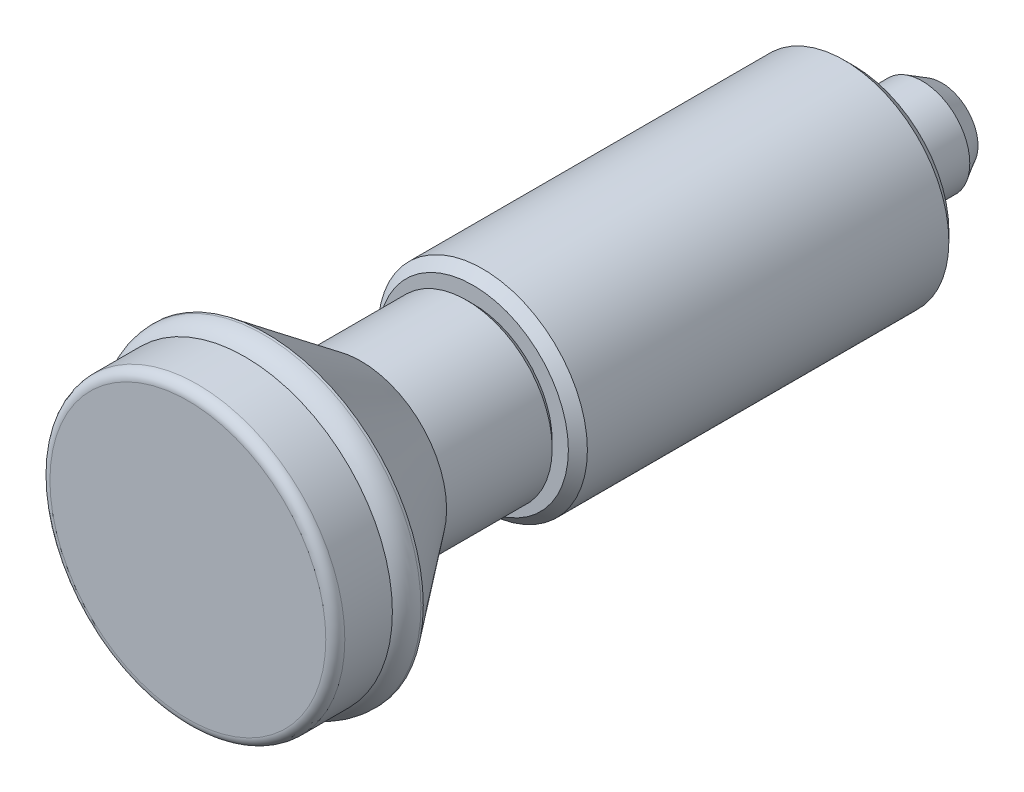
ISO-10303-21;
HEADER;
FILE_DESCRIPTION(('STEP AP214'),'2;1');
FILE_NAME('part.step','',(''),(''),'','','');
FILE_SCHEMA(('AUTOMOTIVE_DESIGN { 1 0 10303 214 1 1 1 1 }'));
ENDSEC;
DATA;
#1=APPLICATION_CONTEXT('core data for automotive mechanical design processes');
#2=APPLICATION_PROTOCOL_DEFINITION('international standard','automotive_design',2000,#1);
#3=PRODUCT_CONTEXT('',#1,'mechanical');
#4=PRODUCT('Part','Part','',(#3));
#5=PRODUCT_RELATED_PRODUCT_CATEGORY('part','',(#4));
#6=PRODUCT_DEFINITION_FORMATION('','',#4);
#7=PRODUCT_DEFINITION_CONTEXT('part definition',#1,'design');
#8=PRODUCT_DEFINITION('design','',#6,#7);
#9=PRODUCT_DEFINITION_SHAPE('','',#8);
#10=(LENGTH_UNIT() NAMED_UNIT(*) SI_UNIT(.MILLI.,.METRE.));
#11=(NAMED_UNIT(*) PLANE_ANGLE_UNIT() SI_UNIT($,.RADIAN.));
#12=(NAMED_UNIT(*) SI_UNIT($,.STERADIAN.) SOLID_ANGLE_UNIT());
#13=UNCERTAINTY_MEASURE_WITH_UNIT(LENGTH_MEASURE(1.E-05),#10,'distance_accuracy_value','');
#14=(GEOMETRIC_REPRESENTATION_CONTEXT(3) GLOBAL_UNCERTAINTY_ASSIGNED_CONTEXT((#13)) GLOBAL_UNIT_ASSIGNED_CONTEXT((#10,
#11,#12)) REPRESENTATION_CONTEXT('',''));
#15=CARTESIAN_POINT('',(0.,0.,0.));
#16=DIRECTION('',(0.,0.,1.));
#17=DIRECTION('',(1.,0.,0.));
#18=AXIS2_PLACEMENT_3D('',#15,#16,#17);
#19=CARTESIAN_POINT('',(0.,0.,69.));
#20=DIRECTION('',(0.,0.,1.));
#21=DIRECTION('',(1.,0.,0.));
#22=AXIS2_PLACEMENT_3D('',#19,#20,#21);
#23=TOROIDAL_SURFACE('',#22,14.5,0.999999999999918);
#24=CARTESIAN_POINT('',(0.,0.,69.));
#25=DIRECTION('',(0.,0.,1.));
#26=DIRECTION('',(1.,0.,0.));
#27=AXIS2_PLACEMENT_3D('',#24,#25,#26);
#28=CIRCLE('',#27,15.5);
#29=CARTESIAN_POINT('',(15.5,0.,69.));
#30=VERTEX_POINT('',#29);
#31=EDGE_CURVE('E8',#30,#30,#28,.T.);
#32=ORIENTED_EDGE('',*,*,#31,.T.);
#33=EDGE_LOOP('',(#32));
#34=FACE_BOUND('',#33,.T.);
#35=CARTESIAN_POINT('',(0.,0.,70.));
#36=DIRECTION('',(0.,0.,1.));
#37=DIRECTION('',(1.,0.,0.));
#38=AXIS2_PLACEMENT_3D('',#35,#36,#37);
#39=CIRCLE('',#38,14.5);
#40=CARTESIAN_POINT('',(14.5,0.,70.));
#41=VERTEX_POINT('',#40);
#42=EDGE_CURVE('E61',#41,#41,#39,.T.);
#43=ORIENTED_EDGE('',*,*,#42,.F.);
#44=EDGE_LOOP('',(#43));
#45=FACE_BOUND('',#44,.T.);
#46=ADVANCED_FACE('F12',(#34,#45),#23,.T.);
#47=CARTESIAN_POINT('',(0.,0.,70.));
#48=DIRECTION('',(0.,0.,1.));
#49=DIRECTION('',(1.,0.,0.));
#50=AXIS2_PLACEMENT_3D('',#47,#48,#49);
#51=CYLINDRICAL_SURFACE('',#50,15.5);
#52=CARTESIAN_POINT('',(0.,0.,64.));
#53=DIRECTION('',(0.,0.,1.));
#54=DIRECTION('',(1.,0.,0.));
#55=AXIS2_PLACEMENT_3D('',#52,#53,#54);
#56=CIRCLE('',#55,15.5);
#57=CARTESIAN_POINT('',(15.5,0.,64.));
#58=VERTEX_POINT('',#57);
#59=EDGE_CURVE('E18',#58,#58,#56,.T.);
#60=ORIENTED_EDGE('',*,*,#59,.T.);
#61=EDGE_LOOP('',(#60));
#62=FACE_BOUND('',#61,.T.);
#63=ORIENTED_EDGE('',*,*,#31,.F.);
#64=EDGE_LOOP('',(#63));
#65=FACE_BOUND('',#64,.T.);
#66=ADVANCED_FACE('F68',(#62,#65),#51,.T.);
#67=CARTESIAN_POINT('',(0.,0.,62.0000000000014));
#68=DIRECTION('',(0.,0.,1.));
#69=DIRECTION('',(1.,0.,0.));
#70=AXIS2_PLACEMENT_3D('',#67,#68,#69);
#71=TOROIDAL_SURFACE('',#70,14.0000000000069,2.49999999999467);
#72=CARTESIAN_POINT('',(0.,0.,62.0000000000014));
#73=DIRECTION('',(0.,0.,1.));
#74=DIRECTION('',(1.,0.,0.));
#75=AXIS2_PLACEMENT_3D('',#72,#73,#74);
#76=CIRCLE('',#75,16.5000000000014);
#77=CARTESIAN_POINT('',(16.5000000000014,0.,62.0000000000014));
#78=VERTEX_POINT('',#77);
#79=EDGE_CURVE('E22',#78,#78,#76,.T.);
#80=ORIENTED_EDGE('',*,*,#79,.T.);
#81=EDGE_LOOP('',(#80));
#82=FACE_BOUND('',#81,.T.);
#83=ORIENTED_EDGE('',*,*,#59,.F.);
#84=EDGE_LOOP('',(#83));
#85=FACE_BOUND('',#84,.T.);
#86=ADVANCED_FACE('F73',(#82,#85),#71,.T.);
#87=CARTESIAN_POINT('',(0.,0.,70.));
#88=DIRECTION('',(0.,0.,1.));
#89=DIRECTION('',(1.,0.,0.));
#90=AXIS2_PLACEMENT_3D('',#87,#88,#89);
#91=CYLINDRICAL_SURFACE('',#90,16.5000000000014);
#92=CARTESIAN_POINT('',(0.,0.,61.7528361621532));
#93=DIRECTION('',(0.,0.,1.));
#94=DIRECTION('',(1.,0.,0.));
#95=AXIS2_PLACEMENT_3D('',#92,#93,#94);
#96=CIRCLE('',#95,16.5000000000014);
#97=CARTESIAN_POINT('',(16.5000000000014,0.,61.7528361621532));
#98=VERTEX_POINT('',#97);
#99=EDGE_CURVE('E26',#98,#98,#96,.T.);
#100=ORIENTED_EDGE('',*,*,#99,.T.);
#101=EDGE_LOOP('',(#100));
#102=FACE_BOUND('',#101,.T.);
#103=ORIENTED_EDGE('',*,*,#79,.F.);
#104=EDGE_LOOP('',(#103));
#105=FACE_BOUND('',#104,.T.);
#106=ADVANCED_FACE('F77',(#102,#105),#91,.T.);
#107=CARTESIAN_POINT('',(0.,0.,61.7528361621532));
#108=DIRECTION('',(0.,0.,1.));
#109=DIRECTION('',(1.,0.,0.));
#110=AXIS2_PLACEMENT_3D('',#107,#108,#109);
#111=CONICAL_SURFACE('',#110,16.5000000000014,0.645771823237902);
#112=CARTESIAN_POINT('',(0.,0.,51.8));
#113=DIRECTION('',(0.,0.,1.));
#114=DIRECTION('',(1.,0.,0.));
#115=AXIS2_PLACEMENT_3D('',#112,#113,#114);
#116=CIRCLE('',#115,9.0000000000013);
#117=CARTESIAN_POINT('',(9.0000000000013,0.,51.8));
#118=VERTEX_POINT('',#117);
#119=EDGE_CURVE('E31',#118,#118,#116,.T.);
#120=ORIENTED_EDGE('',*,*,#119,.T.);
#121=EDGE_LOOP('',(#120));
#122=FACE_BOUND('',#121,.T.);
#123=ORIENTED_EDGE('',*,*,#99,.F.);
#124=EDGE_LOOP('',(#123));
#125=FACE_BOUND('',#124,.T.);
#126=ADVANCED_FACE('F84',(#122,#125),#111,.T.);
#127=CARTESIAN_POINT('',(0.,0.,70.));
#128=DIRECTION('',(0.,0.,1.));
#129=DIRECTION('',(1.,0.,0.));
#130=AXIS2_PLACEMENT_3D('',#127,#128,#129);
#131=CYLINDRICAL_SURFACE('',#130,9.0000000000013);
#132=CARTESIAN_POINT('',(0.,0.,40.7));
#133=DIRECTION('',(0.,0.,1.));
#134=DIRECTION('',(1.,0.,0.));
#135=AXIS2_PLACEMENT_3D('',#132,#133,#134);
#136=CIRCLE('',#135,9.0000000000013);
#137=CARTESIAN_POINT('',(9.0000000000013,0.,40.7));
#138=VERTEX_POINT('',#137);
#139=EDGE_CURVE('E34',#138,#138,#136,.T.);
#140=ORIENTED_EDGE('',*,*,#139,.T.);
#141=EDGE_LOOP('',(#140));
#142=FACE_BOUND('',#141,.T.);
#143=ORIENTED_EDGE('',*,*,#119,.F.);
#144=EDGE_LOOP('',(#143));
#145=FACE_BOUND('',#144,.T.);
#146=ADVANCED_FACE('F88',(#142,#145),#131,.T.);
#147=CARTESIAN_POINT('',(0.,0.,40.7));
#148=DIRECTION('',(0.,0.,1.));
#149=DIRECTION('',(1.,0.,0.));
#150=AXIS2_PLACEMENT_3D('',#147,#148,#149);
#151=CONICAL_SURFACE('',#150,9.0000000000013,0.785398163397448);
#152=CARTESIAN_POINT('',(0.,0.,40.));
#153=DIRECTION('',(0.,0.,1.));
#154=DIRECTION('',(1.,0.,0.));
#155=AXIS2_PLACEMENT_3D('',#152,#153,#154);
#156=CIRCLE('',#155,8.30000000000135);
#157=CARTESIAN_POINT('',(8.30000000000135,0.,40.));
#158=VERTEX_POINT('',#157);
#159=EDGE_CURVE('E37',#158,#158,#156,.T.);
#160=ORIENTED_EDGE('',*,*,#159,.T.);
#161=EDGE_LOOP('',(#160));
#162=FACE_BOUND('',#161,.T.);
#163=ORIENTED_EDGE('',*,*,#139,.F.);
#164=EDGE_LOOP('',(#163));
#165=FACE_BOUND('',#164,.T.);
#166=ADVANCED_FACE('F92',(#162,#165),#151,.T.);
#167=CARTESIAN_POINT('',(0.,10.0000000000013,40.));
#168=DIRECTION('',(0.,0.,1.));
#169=DIRECTION('',(1.,0.,0.));
#170=AXIS2_PLACEMENT_3D('',#167,#168,#169);
#171=PLANE('',#170);
#172=CARTESIAN_POINT('',(0.,0.,40.));
#173=DIRECTION('',(0.,0.,1.));
#174=DIRECTION('',(1.,0.,0.));
#175=AXIS2_PLACEMENT_3D('',#172,#173,#174);
#176=CIRCLE('',#175,10.0000000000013);
#177=CARTESIAN_POINT('',(10.0000000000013,0.,40.));
#178=VERTEX_POINT('',#177);
#179=EDGE_CURVE('E40',#178,#178,#176,.T.);
#180=ORIENTED_EDGE('',*,*,#179,.T.);
#181=EDGE_LOOP('',(#180));
#182=FACE_BOUND('',#181,.T.);
#183=ORIENTED_EDGE('',*,*,#159,.F.);
#184=EDGE_LOOP('',(#183));
#185=FACE_BOUND('',#184,.T.);
#186=ADVANCED_FACE('F96',(#182,#185),#171,.T.);
#187=CARTESIAN_POINT('',(0.,0.,40.));
#188=DIRECTION('',(0.,0.,-1.));
#189=DIRECTION('',(-1.,0.,0.));
#190=AXIS2_PLACEMENT_3D('',#187,#188,#189);
#191=CONICAL_SURFACE('',#190,10.0000000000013,0.785398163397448);
#192=CARTESIAN_POINT('',(0.,0.,39.));
#193=DIRECTION('',(0.,0.,1.));
#194=DIRECTION('',(1.,0.,0.));
#195=AXIS2_PLACEMENT_3D('',#192,#193,#194);
#196=CIRCLE('',#195,11.0000000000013);
#197=CARTESIAN_POINT('',(11.0000000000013,0.,39.));
#198=VERTEX_POINT('',#197);
#199=EDGE_CURVE('E43',#198,#198,#196,.T.);
#200=ORIENTED_EDGE('',*,*,#199,.T.);
#201=EDGE_LOOP('',(#200));
#202=FACE_BOUND('',#201,.T.);
#203=ORIENTED_EDGE('',*,*,#179,.F.);
#204=EDGE_LOOP('',(#203));
#205=FACE_BOUND('',#204,.T.);
#206=ADVANCED_FACE('F100',(#202,#205),#191,.T.);
#207=CARTESIAN_POINT('',(0.,0.,70.));
#208=DIRECTION('',(0.,0.,1.));
#209=DIRECTION('',(1.,0.,0.));
#210=AXIS2_PLACEMENT_3D('',#207,#208,#209);
#211=CYLINDRICAL_SURFACE('',#210,11.0000000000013);
#212=CARTESIAN_POINT('',(0.,0.,1.));
#213=DIRECTION('',(0.,0.,1.));
#214=DIRECTION('',(1.,0.,0.));
#215=AXIS2_PLACEMENT_3D('',#212,#213,#214);
#216=CIRCLE('',#215,11.0000000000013);
#217=CARTESIAN_POINT('',(11.0000000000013,0.,1.));
#218=VERTEX_POINT('',#217);
#219=EDGE_CURVE('E46',#218,#218,#216,.T.);
#220=ORIENTED_EDGE('',*,*,#219,.T.);
#221=EDGE_LOOP('',(#220));
#222=FACE_BOUND('',#221,.T.);
#223=ORIENTED_EDGE('',*,*,#199,.F.);
#224=EDGE_LOOP('',(#223));
#225=FACE_BOUND('',#224,.T.);
#226=ADVANCED_FACE('F104',(#222,#225),#211,.T.);
#227=CARTESIAN_POINT('',(0.,0.,1.));
#228=DIRECTION('',(0.,0.,1.));
#229=DIRECTION('',(1.,0.,0.));
#230=AXIS2_PLACEMENT_3D('',#227,#228,#229);
#231=CONICAL_SURFACE('',#230,11.0000000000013,0.785398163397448);
#232=CARTESIAN_POINT('',(0.,0.,0.));
#233=DIRECTION('',(0.,0.,1.));
#234=DIRECTION('',(1.,0.,0.));
#235=AXIS2_PLACEMENT_3D('',#232,#233,#234);
#236=CIRCLE('',#235,10.0000000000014);
#237=CARTESIAN_POINT('',(10.0000000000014,0.,0.));
#238=VERTEX_POINT('',#237);
#239=EDGE_CURVE('E49',#238,#238,#236,.T.);
#240=ORIENTED_EDGE('',*,*,#239,.T.);
#241=EDGE_LOOP('',(#240));
#242=FACE_BOUND('',#241,.T.);
#243=ORIENTED_EDGE('',*,*,#219,.F.);
#244=EDGE_LOOP('',(#243));
#245=FACE_BOUND('',#244,.T.);
#246=ADVANCED_FACE('F108',(#242,#245),#231,.T.);
#247=CARTESIAN_POINT('',(0.,4.99999999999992,0.));
#248=DIRECTION('',(0.,0.,-1.));
#249=DIRECTION('',(-1.,0.,0.));
#250=AXIS2_PLACEMENT_3D('',#247,#248,#249);
#251=PLANE('',#250);
#252=CARTESIAN_POINT('',(0.,0.,0.));
#253=DIRECTION('',(0.,0.,1.));
#254=DIRECTION('',(1.,0.,0.));
#255=AXIS2_PLACEMENT_3D('',#252,#253,#254);
#256=CIRCLE('',#255,4.99999999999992);
#257=CARTESIAN_POINT('',(4.99999999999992,0.,0.));
#258=VERTEX_POINT('',#257);
#259=EDGE_CURVE('E52',#258,#258,#256,.T.);
#260=ORIENTED_EDGE('',*,*,#259,.T.);
#261=EDGE_LOOP('',(#260));
#262=FACE_BOUND('',#261,.T.);
#263=ORIENTED_EDGE('',*,*,#239,.F.);
#264=EDGE_LOOP('',(#263));
#265=FACE_BOUND('',#264,.T.);
#266=ADVANCED_FACE('F112',(#262,#265),#251,.T.);
#267=CARTESIAN_POINT('',(0.,0.,70.));
#268=DIRECTION('',(0.,0.,1.));
#269=DIRECTION('',(1.,0.,0.));
#270=AXIS2_PLACEMENT_3D('',#267,#268,#269);
#271=CYLINDRICAL_SURFACE('',#270,4.99999999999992);
#272=CARTESIAN_POINT('',(0.,0.,-7.2));
#273=DIRECTION('',(0.,0.,1.));
#274=DIRECTION('',(1.,0.,0.));
#275=AXIS2_PLACEMENT_3D('',#272,#273,#274);
#276=CIRCLE('',#275,4.99999999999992);
#277=CARTESIAN_POINT('',(4.99999999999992,0.,-7.2));
#278=VERTEX_POINT('',#277);
#279=EDGE_CURVE('E55',#278,#278,#276,.T.);
#280=ORIENTED_EDGE('',*,*,#279,.T.);
#281=EDGE_LOOP('',(#280));
#282=FACE_BOUND('',#281,.T.);
#283=ORIENTED_EDGE('',*,*,#259,.F.);
#284=EDGE_LOOP('',(#283));
#285=FACE_BOUND('',#284,.T.);
#286=ADVANCED_FACE('F116',(#282,#285),#271,.T.);
#287=CARTESIAN_POINT('',(0.,0.,-7.2));
#288=DIRECTION('',(0.,0.,1.));
#289=DIRECTION('',(1.,0.,0.));
#290=AXIS2_PLACEMENT_3D('',#287,#288,#289);
#291=CONICAL_SURFACE('',#290,4.99999999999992,0.5235987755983);
#292=CARTESIAN_POINT('',(0.,0.,-9.24093444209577));
#293=DIRECTION('',(0.,0.,1.));
#294=DIRECTION('',(1.,0.,0.));
#295=AXIS2_PLACEMENT_3D('',#292,#293,#294);
#296=CIRCLE('',#295,3.82166595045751);
#297=CARTESIAN_POINT('',(3.82166595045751,0.,-9.24093444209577));
#298=VERTEX_POINT('',#297);
#299=EDGE_CURVE('E58',#298,#298,#296,.T.);
#300=ORIENTED_EDGE('',*,*,#299,.T.);
#301=EDGE_LOOP('',(#300));
#302=FACE_BOUND('',#301,.T.);
#303=ORIENTED_EDGE('',*,*,#279,.F.);
#304=EDGE_LOOP('',(#303));
#305=FACE_BOUND('',#304,.T.);
#306=ADVANCED_FACE('F120',(#302,#305),#291,.T.);
#307=CARTESIAN_POINT('',(0.,0.,0.));
#308=DIRECTION('',(0.,0.,1.));
#309=DIRECTION('',(0.,1.,0.));
#310=AXIS2_PLACEMENT_3D('',#307,#308,#309);
#311=SPHERICAL_SURFACE('',#310,10.);
#312=ORIENTED_EDGE('',*,*,#299,.F.);
#313=EDGE_LOOP('',(#312));
#314=FACE_BOUND('',#313,.T.);
#315=ADVANCED_FACE('F124',(#314),#311,.T.);
#316=CARTESIAN_POINT('',(0.,0.,70.));
#317=DIRECTION('',(0.,0.,1.));
#318=DIRECTION('',(1.,0.,0.));
#319=AXIS2_PLACEMENT_3D('',#316,#317,#318);
#320=PLANE('',#319);
#321=ORIENTED_EDGE('',*,*,#42,.T.);
#322=EDGE_LOOP('',(#321));
#323=FACE_BOUND('',#322,.T.);
#324=ADVANCED_FACE('F65',(#323),#320,.T.);
#325=CLOSED_SHELL('',(#46,#66,#86,#106,#126,#146,#166,#186,#206,#226,#246,#266,#286,#306,#315,#324));
#326=MANIFOLD_SOLID_BREP('B1',#325);
#327=ADVANCED_BREP_SHAPE_REPRESENTATION('',(#18,#326),#14);
#328=SHAPE_DEFINITION_REPRESENTATION(#9,#327);
ENDSEC;
END-ISO-10303-21;
